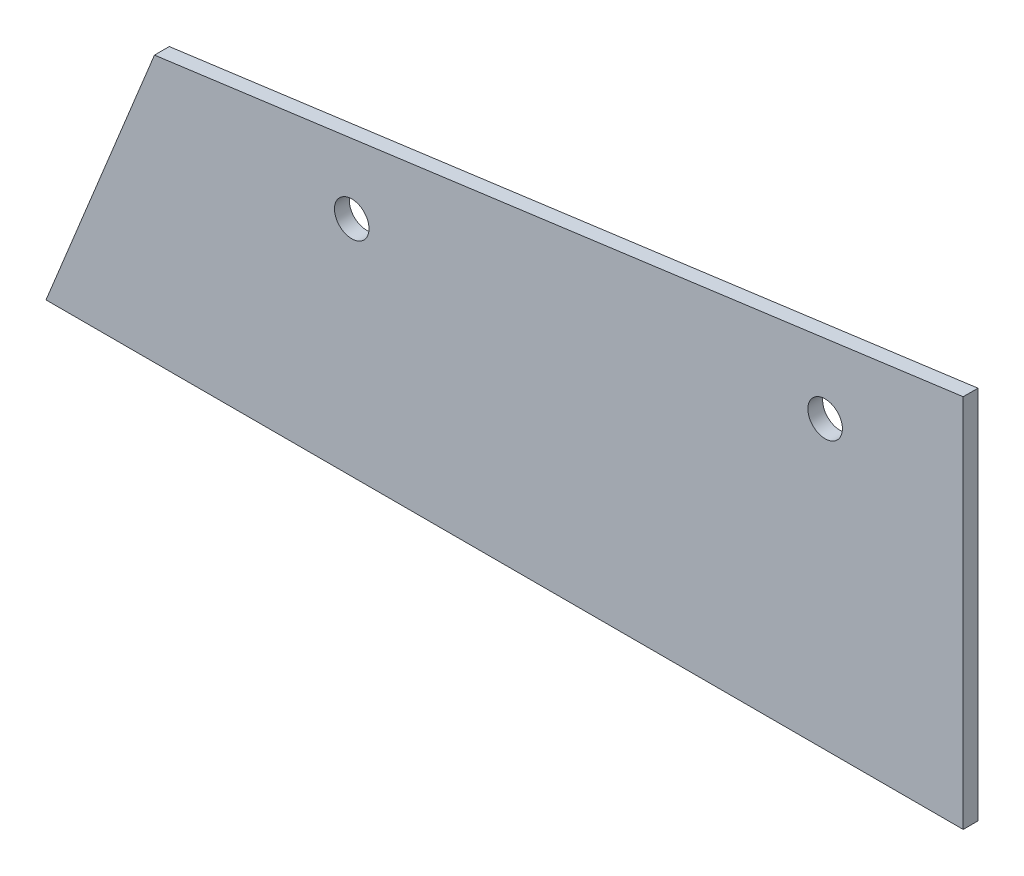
from build123d import *

# Parameters (mm, degrees)
SKETCH1_R      = 1.75
EXTRUDE1_DEPTH = 1.5


with BuildPart() as part:
    # Sketch1 → Extrude1 (new body)
    with BuildSketch(Plane.XY):
        Polygon((0, 0), (93, 0), (93, 38), (11, 27), align=None)
        with Locations((79, 29.059248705)):
            Circle(SKETCH1_R, mode=Mode.SUBTRACT)
        with Locations((31, 22.620224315)):
            Circle(SKETCH1_R, mode=Mode.SUBTRACT)
    extrude(amount=EXTRUDE1_DEPTH)


solid = part.part
